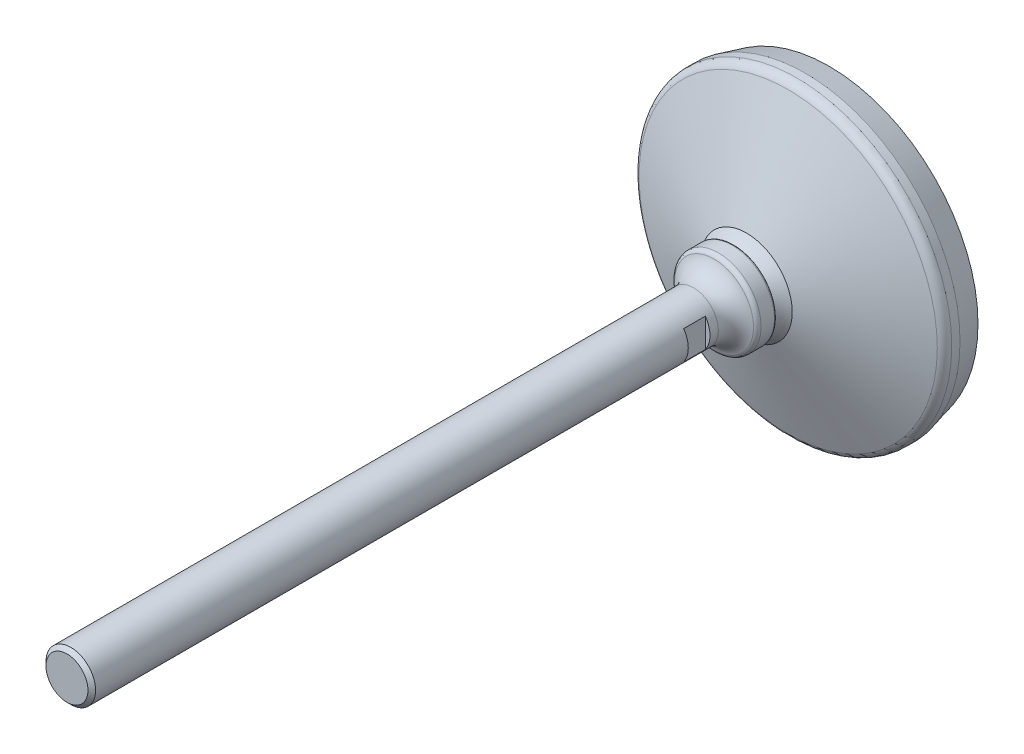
ISO-10303-21;
HEADER;
FILE_DESCRIPTION(('STEP AP214'),'2;1');
FILE_NAME('part.step','',(''),(''),'','','');
FILE_SCHEMA(('AUTOMOTIVE_DESIGN { 1 0 10303 214 1 1 1 1 }'));
ENDSEC;
DATA;
#1=APPLICATION_CONTEXT('core data for automotive mechanical design processes');
#2=APPLICATION_PROTOCOL_DEFINITION('international standard','automotive_design',2000,#1);
#3=PRODUCT_CONTEXT('',#1,'mechanical');
#4=PRODUCT('Part','Part','',(#3));
#5=PRODUCT_RELATED_PRODUCT_CATEGORY('part','',(#4));
#6=PRODUCT_DEFINITION_FORMATION('','',#4);
#7=PRODUCT_DEFINITION_CONTEXT('part definition',#1,'design');
#8=PRODUCT_DEFINITION('design','',#6,#7);
#9=PRODUCT_DEFINITION_SHAPE('','',#8);
#10=(LENGTH_UNIT() NAMED_UNIT(*) SI_UNIT(.MILLI.,.METRE.));
#11=(NAMED_UNIT(*) PLANE_ANGLE_UNIT() SI_UNIT($,.RADIAN.));
#12=(NAMED_UNIT(*) SI_UNIT($,.STERADIAN.) SOLID_ANGLE_UNIT());
#13=UNCERTAINTY_MEASURE_WITH_UNIT(LENGTH_MEASURE(1.E-05),#10,'distance_accuracy_value','');
#14=(GEOMETRIC_REPRESENTATION_CONTEXT(3) GLOBAL_UNCERTAINTY_ASSIGNED_CONTEXT((#13)) GLOBAL_UNIT_ASSIGNED_CONTEXT((#10,
#11,#12)) REPRESENTATION_CONTEXT('',''));
#15=CARTESIAN_POINT('',(0.,0.,0.));
#16=DIRECTION('',(0.,0.,1.));
#17=DIRECTION('',(1.,0.,0.));
#18=AXIS2_PLACEMENT_3D('',#15,#16,#17);
#19=CARTESIAN_POINT('',(0.,0.,35.7420167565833));
#20=DIRECTION('',(0.,0.,-1.));
#21=DIRECTION('',(1.,0.,0.));
#22=AXIS2_PLACEMENT_3D('',#19,#20,#21);
#23=TOROIDAL_SURFACE('',#22,22.6393556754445,12.);
#24=CARTESIAN_POINT('',(0.,0.,26.7));
#25=DIRECTION('',(0.,0.,-1.));
#26=DIRECTION('',(1.,0.,0.));
#27=AXIS2_PLACEMENT_3D('',#24,#25,#26);
#28=CIRCLE('',#27,14.75);
#29=CARTESIAN_POINT('',(14.75,0.,26.7));
#30=VERTEX_POINT('',#29);
#31=EDGE_CURVE('E86',#30,#30,#28,.T.);
#32=ORIENTED_EDGE('',*,*,#31,.F.);
#33=EDGE_LOOP('',(#32));
#34=FACE_BOUND('',#33,.T.);
#35=CARTESIAN_POINT('',(0.,0.,30.7));
#36=DIRECTION('',(0.,0.,-1.));
#37=DIRECTION('',(1.,0.,0.));
#38=AXIS2_PLACEMENT_3D('',#35,#36,#37);
#39=CIRCLE('',#38,11.75);
#40=CARTESIAN_POINT('',(11.75,0.,30.7));
#41=VERTEX_POINT('',#40);
#42=EDGE_CURVE('E61',#41,#41,#39,.T.);
#43=ORIENTED_EDGE('',*,*,#42,.T.);
#44=EDGE_LOOP('',(#43));
#45=FACE_BOUND('',#44,.T.);
#46=ADVANCED_FACE('F14',(#34,#45),#23,.F.);
#47=CARTESIAN_POINT('',(0.,0.,26.7));
#48=DIRECTION('',(0.,0.,-1.));
#49=DIRECTION('',(1.,0.,0.));
#50=AXIS2_PLACEMENT_3D('',#47,#48,#49);
#51=CONICAL_SURFACE('',#50,14.75,1.18784675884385);
#52=CARTESIAN_POINT('',(0.,0.,13.2569409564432));
#53=DIRECTION('',(0.,0.,-1.));
#54=DIRECTION('',(1.,0.,0.));
#55=AXIS2_PLACEMENT_3D('',#52,#53,#54);
#56=CIRCLE('',#55,48.1209740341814);
#57=CARTESIAN_POINT('',(48.1209740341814,0.,13.2569409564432));
#58=VERTEX_POINT('',#57);
#59=EDGE_CURVE('E89',#58,#58,#56,.T.);
#60=CARTESIAN_POINT('',(48.1209740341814,0.,13.2569409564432));
#61=CARTESIAN_POINT('',(47.7733597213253,0.,13.3969728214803));
#62=CARTESIAN_POINT('',(47.4257454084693,0.,13.5370046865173));
#63=CARTESIAN_POINT('',(46.7305167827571,0.,13.8170684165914));
#64=CARTESIAN_POINT('',(46.3829024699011,0.,13.9571002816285));
#65=CARTESIAN_POINT('',(45.687673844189,0.,14.2371640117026));
#66=CARTESIAN_POINT('',(45.3400595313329,0.,14.3771958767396));
#67=CARTESIAN_POINT('',(44.6448309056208,0.,14.6572596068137));
#68=CARTESIAN_POINT('',(44.2972165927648,0.,14.7972914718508));
#69=CARTESIAN_POINT('',(43.6019879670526,0.,15.0773552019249));
#70=CARTESIAN_POINT('',(43.2543736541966,0.,15.2173870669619));
#71=CARTESIAN_POINT('',(42.5591450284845,0.,15.497450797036));
#72=CARTESIAN_POINT('',(42.2115307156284,0.,15.6374826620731));
#73=CARTESIAN_POINT('',(41.5163020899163,0.,15.9175463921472));
#74=CARTESIAN_POINT('',(41.1686877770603,0.,16.0575782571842));
#75=CARTESIAN_POINT('',(40.4734591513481,0.,16.3376419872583));
#76=CARTESIAN_POINT('',(40.1258448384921,0.,16.4776738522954));
#77=CARTESIAN_POINT('',(39.43061621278,0.,16.7577375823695));
#78=CARTESIAN_POINT('',(39.0830018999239,0.,16.8977694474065));
#79=CARTESIAN_POINT('',(38.3877732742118,0.,17.1778331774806));
#80=CARTESIAN_POINT('',(38.0401589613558,0.,17.3178650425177));
#81=CARTESIAN_POINT('',(37.3449303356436,0.,17.5979287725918));
#82=CARTESIAN_POINT('',(36.9973160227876,0.,17.7379606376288));
#83=CARTESIAN_POINT('',(36.3020873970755,0.,18.0180243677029));
#84=CARTESIAN_POINT('',(35.9544730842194,0.,18.15805623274));
#85=CARTESIAN_POINT('',(35.2592444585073,0.,18.4381199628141));
#86=CARTESIAN_POINT('',(34.9116301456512,0.,18.5781518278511));
#87=CARTESIAN_POINT('',(34.2164015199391,0.,18.8582155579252));
#88=CARTESIAN_POINT('',(33.8687872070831,0.,18.9982474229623));
#89=CARTESIAN_POINT('',(33.173558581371,0.,19.2783111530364));
#90=CARTESIAN_POINT('',(32.8259442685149,0.,19.4183430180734));
#91=CARTESIAN_POINT('',(32.1307156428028,0.,19.6984067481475));
#92=CARTESIAN_POINT('',(31.7831013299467,0.,19.8384386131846));
#93=CARTESIAN_POINT('',(31.0878727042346,0.,20.1185023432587));
#94=CARTESIAN_POINT('',(30.7402583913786,0.,20.2585342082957));
#95=CARTESIAN_POINT('',(30.0450297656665,0.,20.5385979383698));
#96=CARTESIAN_POINT('',(29.6974154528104,0.,20.6786298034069));
#97=CARTESIAN_POINT('',(29.0021868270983,0.,20.958693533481));
#98=CARTESIAN_POINT('',(28.6545725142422,0.,21.098725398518));
#99=CARTESIAN_POINT('',(27.9593438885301,0.,21.3787891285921));
#100=CARTESIAN_POINT('',(27.6117295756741,0.,21.5188209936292));
#101=CARTESIAN_POINT('',(26.916500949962,0.,21.7988847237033));
#102=CARTESIAN_POINT('',(26.5688866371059,0.,21.9389165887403));
#103=CARTESIAN_POINT('',(25.8736580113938,0.,22.2189803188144));
#104=CARTESIAN_POINT('',(25.5260436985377,0.,22.3590121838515));
#105=CARTESIAN_POINT('',(24.8308150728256,0.,22.6390759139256));
#106=CARTESIAN_POINT('',(24.4832007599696,0.,22.7791077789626));
#107=CARTESIAN_POINT('',(23.7879721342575,0.,23.0591715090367));
#108=CARTESIAN_POINT('',(23.4403578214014,0.,23.1992033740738));
#109=CARTESIAN_POINT('',(22.7451291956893,0.,23.4792671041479));
#110=CARTESIAN_POINT('',(22.3975148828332,0.,23.6192989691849));
#111=CARTESIAN_POINT('',(21.7022862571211,0.,23.899362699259));
#112=CARTESIAN_POINT('',(21.3546719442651,0.,24.0393945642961));
#113=CARTESIAN_POINT('',(20.6594433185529,0.,24.3194582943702));
#114=CARTESIAN_POINT('',(20.3118290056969,0.,24.4594901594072));
#115=CARTESIAN_POINT('',(19.6166003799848,0.,24.7395538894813));
#116=CARTESIAN_POINT('',(19.2689860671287,0.,24.8795857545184));
#117=CARTESIAN_POINT('',(18.5737574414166,0.,25.1596494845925));
#118=CARTESIAN_POINT('',(18.2261431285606,0.,25.2996813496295));
#119=CARTESIAN_POINT('',(17.5309145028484,0.,25.5797450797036));
#120=CARTESIAN_POINT('',(17.1833001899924,0.,25.7197769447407));
#121=CARTESIAN_POINT('',(16.4880715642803,0.,25.9998406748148));
#122=CARTESIAN_POINT('',(16.1404572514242,0.,26.1398725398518));
#123=CARTESIAN_POINT('',(15.4452286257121,0.,26.4199362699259));
#124=CARTESIAN_POINT('',(15.0976143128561,0.,26.559968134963));
#125=CARTESIAN_POINT('',(14.75,0.,26.7));
#126=B_SPLINE_CURVE_WITH_KNOTS('',3,(#60,#61,#62,#63,#64,#65,#66,#67,#68,#69,#70,#71,#72,#73,
#74,#75,#76,#77,#78,#79,#80,#81,#82,#83,#84,#85,#86,#87,#88,#89,#90,#91,#92,#93,#94,#95,#96,#97,
#98,#99,#100,#101,#102,#103,#104,#105,#106,#107,#108,#109,#110,#111,#112,#113,#114,#115,#116,
#117,#118,#119,#120,#121,#122,#123,#124,#125),.UNSPECIFIED.,.F.,.F.,(4,2,2,2,2,2,2,2,2,2,2,2,2,
2,2,2,2,2,2,2,2,2,2,2,2,2,2,2,2,2,2,2,4),(0.,1.12427830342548,2.24855660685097,3.37283491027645,
4.49711321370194,5.62139151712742,6.7456698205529,7.86994812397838,8.99422642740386,
10.1185047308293,11.2427830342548,12.3670613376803,13.4913396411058,14.6156179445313,
15.7398962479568,16.8641745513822,17.9884528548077,19.1127311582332,20.2370094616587,
21.3612877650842,22.4855660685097,23.6098443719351,24.7341226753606,25.8584009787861,
26.9826792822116,28.1069575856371,29.2312358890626,30.3555141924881,31.4797924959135,
32.604070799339,33.7283491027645,34.85262740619,35.9769057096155),.UNSPECIFIED.);
#127=EDGE_CURVE('BSEAM147',#58,#30,#126,.T.);
#128=ORIENTED_EDGE('',*,*,#59,.F.);
#129=ORIENTED_EDGE('',*,*,#31,.T.);
#130=ORIENTED_EDGE('',*,*,#127,.T.);
#131=ORIENTED_EDGE('',*,*,#127,.F.);
#132=EDGE_LOOP('',(#128,#130,#129,#131));
#133=FACE_BOUND('',#132,.T.);
#134=ADVANCED_FACE('F147',(#133),#51,.T.);
#135=CARTESIAN_POINT('',(0.,0.,10.4742413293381));
#136=DIRECTION('',(0.,0.,-1.));
#137=DIRECTION('',(1.,0.,0.));
#138=AXIS2_PLACEMENT_3D('',#135,#136,#137);
#139=TOROIDAL_SURFACE('',#138,47.,3.);
#140=ORIENTED_EDGE('',*,*,#59,.T.);
#141=EDGE_LOOP('',(#140));
#142=FACE_BOUND('',#141,.T.);
#143=CARTESIAN_POINT('',(0.,0.,10.4742413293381));
#144=DIRECTION('',(0.,0.,-1.));
#145=DIRECTION('',(1.,0.,0.));
#146=AXIS2_PLACEMENT_3D('',#143,#144,#145);
#147=CIRCLE('',#146,50.);
#148=CARTESIAN_POINT('',(50.,0.,10.4742413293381));
#149=VERTEX_POINT('',#148);
#150=EDGE_CURVE('E92',#149,#149,#147,.T.);
#151=ORIENTED_EDGE('',*,*,#150,.F.);
#152=EDGE_LOOP('',(#151));
#153=FACE_BOUND('',#152,.T.);
#154=ADVANCED_FACE('F153',(#142,#153),#139,.T.);
#155=CARTESIAN_POINT('',(0.,0.,0.));
#156=DIRECTION('',(0.,0.,-1.));
#157=DIRECTION('',(1.,0.,0.));
#158=AXIS2_PLACEMENT_3D('',#155,#156,#157);
#159=CYLINDRICAL_SURFACE('',#158,50.);
#160=CARTESIAN_POINT('',(0.,0.,7.8));
#161=DIRECTION('',(0.,0.,-1.));
#162=DIRECTION('',(1.,0.,0.));
#163=AXIS2_PLACEMENT_3D('',#160,#161,#162);
#164=CIRCLE('',#163,50.);
#165=CARTESIAN_POINT('',(50.,0.,7.8));
#166=VERTEX_POINT('',#165);
#167=EDGE_CURVE('E95',#166,#166,#164,.T.);
#168=ORIENTED_EDGE('',*,*,#167,.F.);
#169=EDGE_LOOP('',(#168));
#170=FACE_BOUND('',#169,.T.);
#171=ORIENTED_EDGE('',*,*,#150,.T.);
#172=EDGE_LOOP('',(#171));
#173=FACE_BOUND('',#172,.T.);
#174=ADVANCED_FACE('F198',(#170,#173),#159,.T.);
#175=CARTESIAN_POINT('',(0.,0.,7.8));
#176=DIRECTION('',(0.,0.,1.));
#177=DIRECTION('',(-1.,0.,0.));
#178=AXIS2_PLACEMENT_3D('',#175,#176,#177);
#179=CONICAL_SURFACE('',#178,50.,0.251002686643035);
#180=CARTESIAN_POINT('',(0.,0.,0.));
#181=DIRECTION('',(0.,0.,-1.));
#182=DIRECTION('',(1.,0.,0.));
#183=AXIS2_PLACEMENT_3D('',#180,#181,#182);
#184=CIRCLE('',#183,48.);
#185=CARTESIAN_POINT('',(48.,0.,0.));
#186=VERTEX_POINT('',#185);
#187=EDGE_CURVE('E98',#186,#186,#184,.T.);
#188=ORIENTED_EDGE('',*,*,#187,.F.);
#189=EDGE_LOOP('',(#188));
#190=FACE_BOUND('',#189,.T.);
#191=ORIENTED_EDGE('',*,*,#167,.T.);
#192=EDGE_LOOP('',(#191));
#193=FACE_BOUND('',#192,.T.);
#194=ADVANCED_FACE('F194',(#190,#193),#179,.T.);
#195=CARTESIAN_POINT('',(48.,0.,0.));
#196=DIRECTION('',(0.,0.,1.));
#197=DIRECTION('',(-1.,0.,0.));
#198=AXIS2_PLACEMENT_3D('',#195,#196,#197);
#199=PLANE('',#198);
#200=ORIENTED_EDGE('',*,*,#187,.T.);
#201=EDGE_LOOP('',(#200));
#202=FACE_BOUND('',#201,.T.);
#203=ADVANCED_FACE('F187',(#202),#199,.F.);
#204=CARTESIAN_POINT('',(0.,0.,14.));
#205=DIRECTION('',(0.,0.,-1.));
#206=DIRECTION('',(0.,1.,0.));
#207=AXIS2_PLACEMENT_3D('',#204,#205,#206);
#208=CYLINDRICAL_SURFACE('',#207,8.);
#209=CARTESIAN_POINT('',(0.,0.,43.8));
#210=DIRECTION('',(0.,0.,-1.));
#211=DIRECTION('',(0.,1.,0.));
#212=AXIS2_PLACEMENT_3D('',#209,#210,#211);
#213=CIRCLE('',#212,8.);
#214=CARTESIAN_POINT('',(0.,8.,43.8));
#215=VERTEX_POINT('',#214);
#216=EDGE_CURVE('E107',#215,#215,#213,.T.);
#217=ORIENTED_EDGE('',*,*,#216,.F.);
#218=EDGE_LOOP('',(#217));
#219=FACE_BOUND('',#218,.T.);
#220=DIRECTION('',(0.,0.,-1.));
#221=VECTOR('',#220,1.);
#222=CARTESIAN_POINT('',(6.5,-4.66368952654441,14.));
#223=LINE('',#222,#221);
#224=CARTESIAN_POINT('',(6.5,-4.66368952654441,46.5));
#225=VERTEX_POINT('',#224);
#226=CARTESIAN_POINT('',(6.5,-4.66368952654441,53.5));
#227=VERTEX_POINT('',#226);
#228=EDGE_CURVE('E77',#225,#227,#223,.F.);
#229=ORIENTED_EDGE('',*,*,#228,.T.);
#230=CARTESIAN_POINT('',(0.,0.,53.5));
#231=DIRECTION('',(0.,0.,1.));
#232=DIRECTION('',(0.,-1.,0.));
#233=AXIS2_PLACEMENT_3D('',#230,#231,#232);
#234=CIRCLE('',#233,8.);
#235=CARTESIAN_POINT('',(6.5,4.66368952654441,53.5));
#236=VERTEX_POINT('',#235);
#237=EDGE_CURVE('E9',#227,#236,#234,.T.);
#238=ORIENTED_EDGE('',*,*,#237,.T.);
#239=DIRECTION('',(0.,0.,-1.));
#240=VECTOR('',#239,1.);
#241=CARTESIAN_POINT('',(6.5,4.66368952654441,14.));
#242=LINE('',#241,#240);
#243=CARTESIAN_POINT('',(6.5,4.66368952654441,46.5));
#244=VERTEX_POINT('',#243);
#245=EDGE_CURVE('E17',#236,#244,#242,.T.);
#246=ORIENTED_EDGE('',*,*,#245,.T.);
#247=CARTESIAN_POINT('',(0.,0.,46.5));
#248=DIRECTION('',(0.,0.,1.));
#249=DIRECTION('',(0.,-1.,0.));
#250=AXIS2_PLACEMENT_3D('',#247,#248,#249);
#251=CIRCLE('',#250,8.);
#252=EDGE_CURVE('E63',#225,#244,#251,.T.);
#253=ORIENTED_EDGE('',*,*,#252,.F.);
#254=EDGE_LOOP('',(#229,#238,#246,#253));
#255=FACE_BOUND('',#254,.T.);
#256=DIRECTION('',(0.,0.,-1.));
#257=VECTOR('',#256,1.);
#258=CARTESIAN_POINT('',(-6.5,4.66368952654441,14.));
#259=LINE('',#258,#257);
#260=CARTESIAN_POINT('',(-6.5,4.66368952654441,46.5));
#261=VERTEX_POINT('',#260);
#262=CARTESIAN_POINT('',(-6.5,4.66368952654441,53.5));
#263=VERTEX_POINT('',#262);
#264=EDGE_CURVE('E60',#261,#263,#259,.F.);
#265=ORIENTED_EDGE('',*,*,#264,.T.);
#266=CARTESIAN_POINT('',(-6.5,-4.66368952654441,53.5));
#267=VERTEX_POINT('',#266);
#268=EDGE_CURVE('E23',#263,#267,#234,.T.);
#269=ORIENTED_EDGE('',*,*,#268,.T.);
#270=DIRECTION('',(0.,0.,-1.));
#271=VECTOR('',#270,1.);
#272=CARTESIAN_POINT('',(-6.5,-4.66368952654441,14.));
#273=LINE('',#272,#271);
#274=CARTESIAN_POINT('',(-6.5,-4.66368952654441,46.5));
#275=VERTEX_POINT('',#274);
#276=EDGE_CURVE('E67',#267,#275,#273,.T.);
#277=ORIENTED_EDGE('',*,*,#276,.T.);
#278=EDGE_CURVE('E55',#261,#275,#251,.T.);
#279=ORIENTED_EDGE('',*,*,#278,.F.);
#280=EDGE_LOOP('',(#265,#269,#277,#279));
#281=FACE_BOUND('',#280,.T.);
#282=CARTESIAN_POINT('',(0.,0.,244.773));
#283=DIRECTION('',(0.,0.,-1.));
#284=DIRECTION('',(0.,1.,0.));
#285=AXIS2_PLACEMENT_3D('',#282,#283,#284);
#286=CIRCLE('',#285,8.);
#287=CARTESIAN_POINT('',(0.,8.,244.773));
#288=VERTEX_POINT('',#287);
#289=EDGE_CURVE('E104',#288,#288,#286,.T.);
#290=ORIENTED_EDGE('',*,*,#289,.T.);
#291=EDGE_LOOP('',(#290));
#292=FACE_BOUND('',#291,.T.);
#293=ADVANCED_FACE('F73',(#219,#255,#281,#292),#208,.T.);
#294=CARTESIAN_POINT('',(0.,0.,43.8));
#295=DIRECTION('',(0.,0.,-1.));
#296=DIRECTION('',(0.,1.,0.));
#297=AXIS2_PLACEMENT_3D('',#294,#295,#296);
#298=TOROIDAL_SURFACE('',#297,15.,7.);
#299=CARTESIAN_POINT('',(0.,0.,37.176473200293));
#300=DIRECTION('',(0.,0.,-1.));
#301=DIRECTION('',(0.,1.,0.));
#302=AXIS2_PLACEMENT_3D('',#299,#300,#301);
#303=CIRCLE('',#302,12.7352941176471);
#304=CARTESIAN_POINT('',(0.,12.7352941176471,37.176473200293));
#305=VERTEX_POINT('',#304);
#306=EDGE_CURVE('E110',#305,#305,#303,.T.);
#307=ORIENTED_EDGE('',*,*,#306,.F.);
#308=EDGE_LOOP('',(#307));
#309=FACE_BOUND('',#308,.T.);
#310=ORIENTED_EDGE('',*,*,#216,.T.);
#311=EDGE_LOOP('',(#310));
#312=FACE_BOUND('',#311,.T.);
#313=ADVANCED_FACE('F180',(#309,#312),#298,.F.);
#314=CARTESIAN_POINT('',(0.,0.,35.7571460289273));
#315=DIRECTION('',(0.,0.,-1.));
#316=DIRECTION('',(0.,1.,0.));
#317=AXIS2_PLACEMENT_3D('',#314,#315,#316);
#318=TOROIDAL_SURFACE('',#317,12.25,1.5);
#319=ORIENTED_EDGE('',*,*,#306,.T.);
#320=EDGE_LOOP('',(#319));
#321=FACE_BOUND('',#320,.T.);
#322=CARTESIAN_POINT('',(0.,0.,35.7571460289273));
#323=DIRECTION('',(0.,0.,-1.));
#324=DIRECTION('',(0.,1.,0.));
#325=AXIS2_PLACEMENT_3D('',#322,#323,#324);
#326=CIRCLE('',#325,13.75);
#327=CARTESIAN_POINT('',(0.,13.75,35.7571460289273));
#328=VERTEX_POINT('',#327);
#329=EDGE_CURVE('E113',#328,#328,#326,.T.);
#330=ORIENTED_EDGE('',*,*,#329,.F.);
#331=EDGE_LOOP('',(#330));
#332=FACE_BOUND('',#331,.T.);
#333=ADVANCED_FACE('F173',(#321,#332),#318,.T.);
#334=CARTESIAN_POINT('',(0.,0.,14.));
#335=DIRECTION('',(0.,0.,-1.));
#336=DIRECTION('',(0.,1.,0.));
#337=AXIS2_PLACEMENT_3D('',#334,#335,#336);
#338=CYLINDRICAL_SURFACE('',#337,13.75);
#339=CARTESIAN_POINT('',(0.,0.,31.45));
#340=DIRECTION('',(0.,0.,-1.));
#341=DIRECTION('',(0.,1.,0.));
#342=AXIS2_PLACEMENT_3D('',#339,#340,#341);
#343=CIRCLE('',#342,13.75);
#344=CARTESIAN_POINT('',(0.,13.75,31.45));
#345=VERTEX_POINT('',#344);
#346=EDGE_CURVE('E116',#345,#345,#343,.T.);
#347=ORIENTED_EDGE('',*,*,#346,.F.);
#348=EDGE_LOOP('',(#347));
#349=FACE_BOUND('',#348,.T.);
#350=ORIENTED_EDGE('',*,*,#329,.T.);
#351=EDGE_LOOP('',(#350));
#352=FACE_BOUND('',#351,.T.);
#353=ADVANCED_FACE('F166',(#349,#352),#338,.T.);
#354=CARTESIAN_POINT('',(0.,0.,31.45));
#355=DIRECTION('',(0.,0.,-1.));
#356=DIRECTION('',(0.,1.,0.));
#357=AXIS2_PLACEMENT_3D('',#354,#355,#356);
#358=TOROIDAL_SURFACE('',#357,13.,0.75);
#359=ORIENTED_EDGE('',*,*,#346,.T.);
#360=EDGE_LOOP('',(#359));
#361=FACE_BOUND('',#360,.T.);
#362=CARTESIAN_POINT('',(0.,0.,30.7));
#363=DIRECTION('',(0.,0.,-1.));
#364=DIRECTION('',(0.,1.,0.));
#365=AXIS2_PLACEMENT_3D('',#362,#363,#364);
#366=CIRCLE('',#365,13.);
#367=CARTESIAN_POINT('',(0.,13.,30.7));
#368=VERTEX_POINT('',#367);
#369=EDGE_CURVE('E119',#368,#368,#366,.T.);
#370=ORIENTED_EDGE('',*,*,#369,.F.);
#371=EDGE_LOOP('',(#370));
#372=FACE_BOUND('',#371,.T.);
#373=ADVANCED_FACE('F161',(#361,#372),#358,.T.);
#374=CARTESIAN_POINT('',(13.,0.,30.7));
#375=DIRECTION('',(0.,0.,1.));
#376=DIRECTION('',(0.,-1.,0.));
#377=AXIS2_PLACEMENT_3D('',#374,#375,#376);
#378=PLANE('',#377);
#379=ORIENTED_EDGE('',*,*,#42,.F.);
#380=EDGE_LOOP('',(#379));
#381=FACE_BOUND('',#380,.T.);
#382=ORIENTED_EDGE('',*,*,#369,.T.);
#383=EDGE_LOOP('',(#382));
#384=FACE_BOUND('',#383,.T.);
#385=ADVANCED_FACE('F145',(#381,#384),#378,.F.);
#386=CARTESIAN_POINT('',(0.,0.,46.5));
#387=DIRECTION('',(0.,0.,1.));
#388=DIRECTION('',(0.,-1.,0.));
#389=AXIS2_PLACEMENT_3D('',#386,#387,#388);
#390=PLANE('',#389);
#391=ORIENTED_EDGE('',*,*,#278,.T.);
#392=DIRECTION('',(0.,-1.,0.));
#393=VECTOR('',#392,1.);
#394=CARTESIAN_POINT('',(-6.5,16.,46.5));
#395=LINE('',#394,#393);
#396=EDGE_CURVE('E29',#261,#275,#395,.T.);
#397=ORIENTED_EDGE('',*,*,#396,.F.);
#398=EDGE_LOOP('',(#391,#397));
#399=FACE_BOUND('',#398,.T.);
#400=ADVANCED_FACE('F56',(#399),#390,.T.);
#401=CARTESIAN_POINT('',(0.,0.,53.5));
#402=DIRECTION('',(0.,0.,1.));
#403=DIRECTION('',(0.,-1.,0.));
#404=AXIS2_PLACEMENT_3D('',#401,#402,#403);
#405=PLANE('',#404);
#406=DIRECTION('',(0.,-1.,0.));
#407=VECTOR('',#406,1.);
#408=CARTESIAN_POINT('',(-6.5,16.,53.5));
#409=LINE('',#408,#407);
#410=EDGE_CURVE('E121',#263,#267,#409,.T.);
#411=ORIENTED_EDGE('',*,*,#410,.T.);
#412=ORIENTED_EDGE('',*,*,#268,.F.);
#413=EDGE_LOOP('',(#411,#412));
#414=FACE_BOUND('',#413,.T.);
#415=ADVANCED_FACE('F142',(#414),#405,.F.);
#416=CARTESIAN_POINT('',(-6.5,16.,53.5));
#417=DIRECTION('',(1.,0.,0.));
#418=DIRECTION('',(0.,1.,0.));
#419=AXIS2_PLACEMENT_3D('',#416,#417,#418);
#420=PLANE('',#419);
#421=ORIENTED_EDGE('',*,*,#410,.F.);
#422=ORIENTED_EDGE('',*,*,#264,.F.);
#423=ORIENTED_EDGE('',*,*,#396,.T.);
#424=ORIENTED_EDGE('',*,*,#276,.F.);
#425=EDGE_LOOP('',(#421,#422,#423,#424));
#426=FACE_BOUND('',#425,.T.);
#427=ADVANCED_FACE('F66',(#426),#420,.F.);
#428=CARTESIAN_POINT('',(6.5,-16.,53.5));
#429=DIRECTION('',(-1.,0.,0.));
#430=DIRECTION('',(0.,-1.,0.));
#431=AXIS2_PLACEMENT_3D('',#428,#429,#430);
#432=PLANE('',#431);
#433=DIRECTION('',(0.,1.,0.));
#434=VECTOR('',#433,1.);
#435=CARTESIAN_POINT('',(6.5,-16.,53.5));
#436=LINE('',#435,#434);
#437=EDGE_CURVE('E69',#227,#236,#436,.T.);
#438=ORIENTED_EDGE('',*,*,#437,.F.);
#439=ORIENTED_EDGE('',*,*,#228,.F.);
#440=DIRECTION('',(0.,1.,0.));
#441=VECTOR('',#440,1.);
#442=CARTESIAN_POINT('',(6.5,-16.,46.5));
#443=LINE('',#442,#441);
#444=EDGE_CURVE('E70',#225,#244,#443,.T.);
#445=ORIENTED_EDGE('',*,*,#444,.T.);
#446=ORIENTED_EDGE('',*,*,#245,.F.);
#447=EDGE_LOOP('',(#438,#439,#445,#446));
#448=FACE_BOUND('',#447,.T.);
#449=ADVANCED_FACE('F127',(#448),#432,.F.);
#450=ORIENTED_EDGE('',*,*,#437,.T.);
#451=ORIENTED_EDGE('',*,*,#237,.F.);
#452=EDGE_LOOP('',(#450,#451));
#453=FACE_BOUND('',#452,.T.);
#454=ADVANCED_FACE('F126',(#453),#405,.F.);
#455=ORIENTED_EDGE('',*,*,#444,.F.);
#456=ORIENTED_EDGE('',*,*,#252,.T.);
#457=EDGE_LOOP('',(#455,#456));
#458=FACE_BOUND('',#457,.T.);
#459=ADVANCED_FACE('F128',(#458),#390,.T.);
#460=CARTESIAN_POINT('',(0.,0.,246.));
#461=DIRECTION('',(0.,0.,-1.));
#462=DIRECTION('',(0.,1.,0.));
#463=AXIS2_PLACEMENT_3D('',#460,#461,#462);
#464=PLANE('',#463);
#465=CARTESIAN_POINT('',(0.,0.,246.));
#466=DIRECTION('',(0.,0.,-1.));
#467=DIRECTION('',(0.,1.,0.));
#468=AXIS2_PLACEMENT_3D('',#465,#466,#467);
#469=CIRCLE('',#468,6.773);
#470=CARTESIAN_POINT('',(0.,6.773,246.));
#471=VERTEX_POINT('',#470);
#472=EDGE_CURVE('E101',#471,#471,#469,.T.);
#473=ORIENTED_EDGE('',*,*,#472,.F.);
#474=EDGE_LOOP('',(#473));
#475=FACE_BOUND('',#474,.T.);
#476=ADVANCED_FACE('F130',(#475),#464,.F.);
#477=CARTESIAN_POINT('',(0.,0.,246.));
#478=DIRECTION('',(0.,0.,-1.));
#479=DIRECTION('',(0.,1.,0.));
#480=AXIS2_PLACEMENT_3D('',#477,#478,#479);
#481=CONICAL_SURFACE('',#480,6.773,0.785398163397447);
#482=ORIENTED_EDGE('',*,*,#289,.F.);
#483=EDGE_LOOP('',(#482));
#484=FACE_BOUND('',#483,.T.);
#485=ORIENTED_EDGE('',*,*,#472,.T.);
#486=EDGE_LOOP('',(#485));
#487=FACE_BOUND('',#486,.T.);
#488=ADVANCED_FACE('F138',(#484,#487),#481,.T.);
#489=CLOSED_SHELL('',(#46,#134,#154,#174,#194,#203,#293,#313,#333,#353,#373,#385,#400,#415,#427,
#449,#454,#459,#476,#488));
#490=MANIFOLD_SOLID_BREP('B1',#489);
#491=ADVANCED_BREP_SHAPE_REPRESENTATION('',(#18,#490),#14);
#492=SHAPE_DEFINITION_REPRESENTATION(#9,#491);
ENDSEC;
END-ISO-10303-21;
